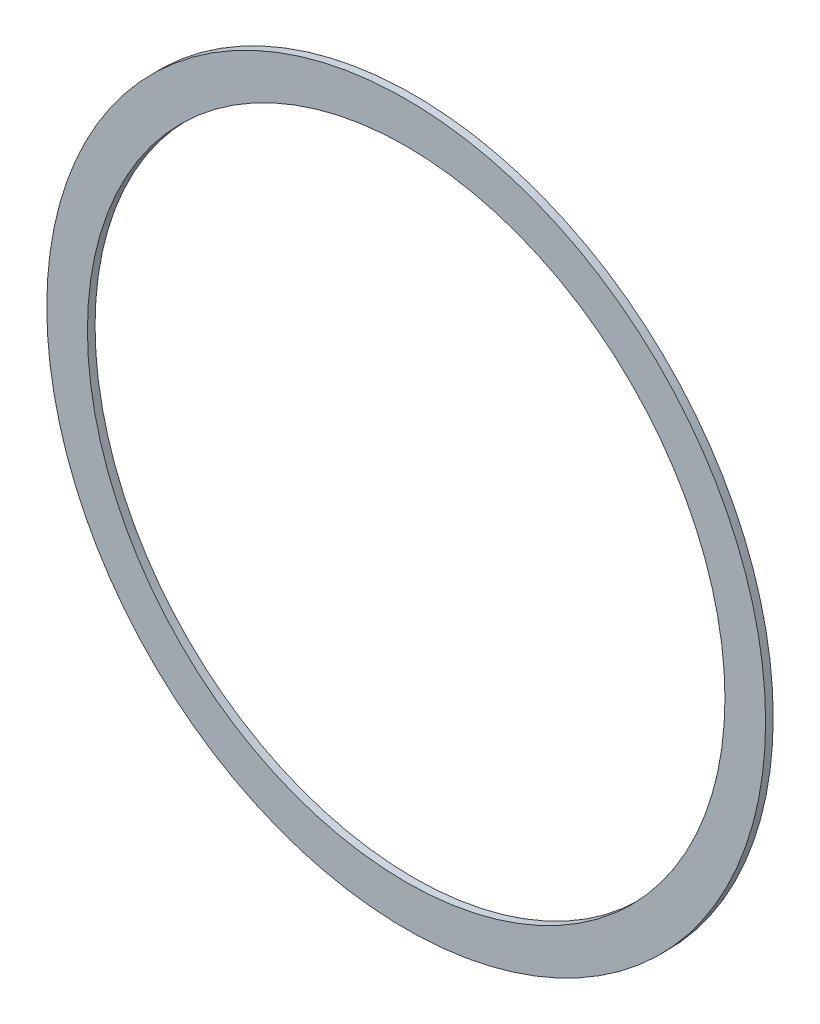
ISO-10303-21;
HEADER;
FILE_DESCRIPTION(('STEP AP214'),'2;1');
FILE_NAME('part.step','',(''),(''),'','','');
FILE_SCHEMA(('AUTOMOTIVE_DESIGN { 1 0 10303 214 1 1 1 1 }'));
ENDSEC;
DATA;
#1=APPLICATION_CONTEXT('core data for automotive mechanical design processes');
#2=APPLICATION_PROTOCOL_DEFINITION('international standard','automotive_design',2000,#1);
#3=PRODUCT_CONTEXT('',#1,'mechanical');
#4=PRODUCT('Part','Part','',(#3));
#5=PRODUCT_RELATED_PRODUCT_CATEGORY('part','',(#4));
#6=PRODUCT_DEFINITION_FORMATION('','',#4);
#7=PRODUCT_DEFINITION_CONTEXT('part definition',#1,'design');
#8=PRODUCT_DEFINITION('design','',#6,#7);
#9=PRODUCT_DEFINITION_SHAPE('','',#8);
#10=(LENGTH_UNIT() NAMED_UNIT(*) SI_UNIT(.MILLI.,.METRE.));
#11=(NAMED_UNIT(*) PLANE_ANGLE_UNIT() SI_UNIT($,.RADIAN.));
#12=(NAMED_UNIT(*) SI_UNIT($,.STERADIAN.) SOLID_ANGLE_UNIT());
#13=UNCERTAINTY_MEASURE_WITH_UNIT(LENGTH_MEASURE(1.E-05),#10,'distance_accuracy_value','');
#14=(GEOMETRIC_REPRESENTATION_CONTEXT(3) GLOBAL_UNCERTAINTY_ASSIGNED_CONTEXT((#13)) GLOBAL_UNIT_ASSIGNED_CONTEXT((#10,
#11,#12)) REPRESENTATION_CONTEXT('',''));
#15=CARTESIAN_POINT('',(0.,0.,0.));
#16=DIRECTION('',(0.,0.,1.));
#17=DIRECTION('',(1.,0.,0.));
#18=AXIS2_PLACEMENT_3D('',#15,#16,#17);
#19=CARTESIAN_POINT('',(0.,0.,3.));
#20=DIRECTION('',(0.,0.,-1.));
#21=DIRECTION('',(-1.,0.,0.));
#22=AXIS2_PLACEMENT_3D('',#19,#20,#21);
#23=CYLINDRICAL_SURFACE('',#22,141.5);
#24=CARTESIAN_POINT('',(0.,0.,3.));
#25=DIRECTION('',(0.,0.,1.));
#26=DIRECTION('',(1.,0.,0.));
#27=AXIS2_PLACEMENT_3D('',#24,#25,#26);
#28=CIRCLE('',#27,141.5);
#29=CARTESIAN_POINT('',(141.5,0.,3.));
#30=VERTEX_POINT('',#29);
#31=EDGE_CURVE('E10',#30,#30,#28,.T.);
#32=ORIENTED_EDGE('',*,*,#31,.F.);
#33=EDGE_LOOP('',(#32));
#34=FACE_BOUND('',#33,.T.);
#35=CARTESIAN_POINT('',(0.,0.,0.));
#36=DIRECTION('',(0.,0.,1.));
#37=DIRECTION('',(1.,0.,0.));
#38=AXIS2_PLACEMENT_3D('',#35,#36,#37);
#39=CIRCLE('',#38,141.5);
#40=CARTESIAN_POINT('',(141.5,0.,0.));
#41=VERTEX_POINT('',#40);
#42=EDGE_CURVE('E37',#41,#41,#39,.T.);
#43=ORIENTED_EDGE('',*,*,#42,.T.);
#44=EDGE_LOOP('',(#43));
#45=FACE_BOUND('',#44,.T.);
#46=ADVANCED_FACE('F34',(#34,#45),#23,.T.);
#47=CARTESIAN_POINT('',(0.,0.,3.));
#48=DIRECTION('',(0.,0.,1.));
#49=DIRECTION('',(1.,0.,0.));
#50=AXIS2_PLACEMENT_3D('',#47,#48,#49);
#51=PLANE('',#50);
#52=CARTESIAN_POINT('',(0.,0.,3.));
#53=DIRECTION('',(0.,0.,1.));
#54=DIRECTION('',(1.,0.,0.));
#55=AXIS2_PLACEMENT_3D('',#52,#53,#54);
#56=CIRCLE('',#55,125.5);
#57=CARTESIAN_POINT('',(125.5,0.,3.));
#58=VERTEX_POINT('',#57);
#59=EDGE_CURVE('E46',#58,#58,#56,.T.);
#60=ORIENTED_EDGE('',*,*,#59,.F.);
#61=EDGE_LOOP('',(#60));
#62=FACE_BOUND('',#61,.T.);
#63=ORIENTED_EDGE('',*,*,#31,.T.);
#64=EDGE_LOOP('',(#63));
#65=FACE_BOUND('',#64,.T.);
#66=ADVANCED_FACE('F61',(#62,#65),#51,.T.);
#67=CARTESIAN_POINT('',(0.,0.,0.));
#68=DIRECTION('',(0.,0.,1.));
#69=DIRECTION('',(1.,0.,0.));
#70=AXIS2_PLACEMENT_3D('',#67,#68,#69);
#71=PLANE('',#70);
#72=CARTESIAN_POINT('',(0.,0.,0.));
#73=DIRECTION('',(0.,0.,1.));
#74=DIRECTION('',(1.,0.,0.));
#75=AXIS2_PLACEMENT_3D('',#72,#73,#74);
#76=CIRCLE('',#75,125.5);
#77=CARTESIAN_POINT('',(125.5,0.,0.));
#78=VERTEX_POINT('',#77);
#79=EDGE_CURVE('E44',#78,#78,#76,.T.);
#80=ORIENTED_EDGE('',*,*,#79,.T.);
#81=EDGE_LOOP('',(#80));
#82=FACE_BOUND('',#81,.T.);
#83=ORIENTED_EDGE('',*,*,#42,.F.);
#84=EDGE_LOOP('',(#83));
#85=FACE_BOUND('',#84,.T.);
#86=ADVANCED_FACE('F52',(#82,#85),#71,.F.);
#87=CARTESIAN_POINT('',(0.,0.,0.));
#88=DIRECTION('',(0.,0.,1.));
#89=DIRECTION('',(1.,0.,0.));
#90=AXIS2_PLACEMENT_3D('',#87,#88,#89);
#91=CYLINDRICAL_SURFACE('',#90,125.5);
#92=ORIENTED_EDGE('',*,*,#79,.F.);
#93=EDGE_LOOP('',(#92));
#94=FACE_BOUND('',#93,.T.);
#95=ORIENTED_EDGE('',*,*,#59,.T.);
#96=EDGE_LOOP('',(#95));
#97=FACE_BOUND('',#96,.T.);
#98=ADVANCED_FACE('F55',(#94,#97),#91,.F.);
#99=CLOSED_SHELL('',(#46,#66,#86,#98));
#100=MANIFOLD_SOLID_BREP('B2',#99);
#101=ADVANCED_BREP_SHAPE_REPRESENTATION('',(#18,#100),#14);
#102=SHAPE_DEFINITION_REPRESENTATION(#9,#101);
ENDSEC;
END-ISO-10303-21;
